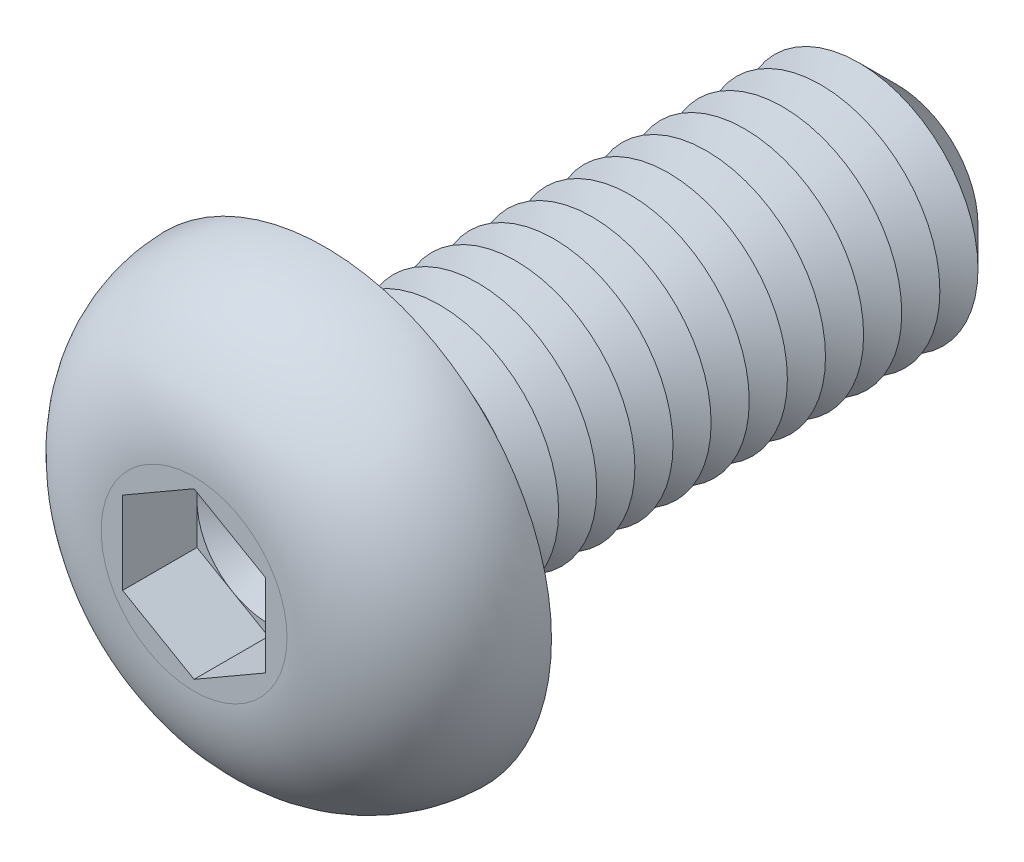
ISO-10303-21;
HEADER;
FILE_DESCRIPTION(('STEP AP214'),'2;1');
FILE_NAME('part.step','',(''),(''),'','','');
FILE_SCHEMA(('AUTOMOTIVE_DESIGN { 1 0 10303 214 1 1 1 1 }'));
ENDSEC;
DATA;
#1=APPLICATION_CONTEXT('core data for automotive mechanical design processes');
#2=APPLICATION_PROTOCOL_DEFINITION('international standard','automotive_design',2000,#1);
#3=PRODUCT_CONTEXT('',#1,'mechanical');
#4=PRODUCT('Part','Part','',(#3));
#5=PRODUCT_RELATED_PRODUCT_CATEGORY('part','',(#4));
#6=PRODUCT_DEFINITION_FORMATION('','',#4);
#7=PRODUCT_DEFINITION_CONTEXT('part definition',#1,'design');
#8=PRODUCT_DEFINITION('design','',#6,#7);
#9=PRODUCT_DEFINITION_SHAPE('','',#8);
#10=(LENGTH_UNIT() NAMED_UNIT(*) SI_UNIT(.MILLI.,.METRE.));
#11=(NAMED_UNIT(*) PLANE_ANGLE_UNIT() SI_UNIT($,.RADIAN.));
#12=(NAMED_UNIT(*) SI_UNIT($,.STERADIAN.) SOLID_ANGLE_UNIT());
#13=UNCERTAINTY_MEASURE_WITH_UNIT(LENGTH_MEASURE(1.E-05),#10,'distance_accuracy_value','');
#14=(GEOMETRIC_REPRESENTATION_CONTEXT(3) GLOBAL_UNCERTAINTY_ASSIGNED_CONTEXT((#13)) GLOBAL_UNIT_ASSIGNED_CONTEXT((#10,
#11,#12)) REPRESENTATION_CONTEXT('',''));
#15=CARTESIAN_POINT('',(0.,0.,0.));
#16=DIRECTION('',(0.,0.,1.));
#17=DIRECTION('',(1.,0.,0.));
#18=AXIS2_PLACEMENT_3D('',#15,#16,#17);
#19=CARTESIAN_POINT('',(0.,0.,1.19));
#20=DIRECTION('',(0.,0.,1.));
#21=DIRECTION('',(1.,0.,0.));
#22=AXIS2_PLACEMENT_3D('',#19,#20,#21);
#23=PLANE('',#22);
#24=CARTESIAN_POINT('',(0.,0.,1.19));
#25=DIRECTION('',(0.,0.,1.));
#26=DIRECTION('',(1.,0.,0.));
#27=AXIS2_PLACEMENT_3D('',#24,#25,#26);
#28=CIRCLE('',#27,1.5);
#29=CARTESIAN_POINT('',(1.5,0.,1.19));
#30=VERTEX_POINT('',#29);
#31=CARTESIAN_POINT('',(0.75,1.29903810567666,1.19));
#32=VERTEX_POINT('',#31);
#33=EDGE_CURVE('E117',#30,#32,#28,.T.);
#34=ORIENTED_EDGE('',*,*,#33,.F.);
#35=DIRECTION('',(0.,1.,0.));
#36=VECTOR('',#35,1.);
#37=CARTESIAN_POINT('',(1.5,-0.866025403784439,1.19));
#38=LINE('',#37,#36);
#39=CARTESIAN_POINT('',(1.5,0.86602540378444,1.19));
#40=VERTEX_POINT('',#39);
#41=EDGE_CURVE('E140',#30,#40,#38,.T.);
#42=ORIENTED_EDGE('',*,*,#41,.T.);
#43=DIRECTION('',(-0.866025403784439,0.5,0.));
#44=VECTOR('',#43,1.);
#45=CARTESIAN_POINT('',(1.5,0.86602540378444,1.19));
#46=LINE('',#45,#44);
#47=EDGE_CURVE('E135',#40,#32,#46,.T.);
#48=ORIENTED_EDGE('',*,*,#47,.T.);
#49=EDGE_LOOP('',(#34,#42,#48));
#50=FACE_BOUND('',#49,.T.);
#51=ADVANCED_FACE('F39',(#50),#23,.T.);
#52=CARTESIAN_POINT('',(0.,0.,1.19));
#53=DIRECTION('',(0.,0.,1.));
#54=DIRECTION('',(1.,0.,0.));
#55=AXIS2_PLACEMENT_3D('',#52,#53,#54);
#56=CIRCLE('',#55,1.5);
#57=CARTESIAN_POINT('',(-0.75,1.29903810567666,1.19));
#58=VERTEX_POINT('',#57);
#59=EDGE_CURVE('E11',#32,#58,#56,.T.);
#60=ORIENTED_EDGE('',*,*,#59,.F.);
#61=CARTESIAN_POINT('',(0.,1.73205080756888,1.19));
#62=VERTEX_POINT('',#61);
#63=EDGE_CURVE('E130',#32,#62,#46,.T.);
#64=ORIENTED_EDGE('',*,*,#63,.T.);
#65=DIRECTION('',(-0.866025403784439,-0.5,0.));
#66=VECTOR('',#65,1.);
#67=CARTESIAN_POINT('',(0.,1.73205080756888,1.19));
#68=LINE('',#67,#66);
#69=EDGE_CURVE('E132',#62,#58,#68,.T.);
#70=ORIENTED_EDGE('',*,*,#69,.T.);
#71=EDGE_LOOP('',(#60,#64,#70));
#72=FACE_BOUND('',#71,.T.);
#73=ADVANCED_FACE('F129',(#72),#23,.T.);
#74=CARTESIAN_POINT('',(-1.5,0.,1.19));
#75=VERTEX_POINT('',#74);
#76=EDGE_CURVE('E49',#58,#75,#56,.T.);
#77=ORIENTED_EDGE('',*,*,#76,.F.);
#78=CARTESIAN_POINT('',(-1.5,0.866025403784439,1.19));
#79=VERTEX_POINT('',#78);
#80=EDGE_CURVE('E143',#58,#79,#68,.T.);
#81=ORIENTED_EDGE('',*,*,#80,.T.);
#82=DIRECTION('',(0.,-1.,0.));
#83=VECTOR('',#82,1.);
#84=CARTESIAN_POINT('',(-1.5,0.866025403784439,1.19));
#85=LINE('',#84,#83);
#86=EDGE_CURVE('E154',#79,#75,#85,.T.);
#87=ORIENTED_EDGE('',*,*,#86,.T.);
#88=EDGE_LOOP('',(#77,#81,#87));
#89=FACE_BOUND('',#88,.T.);
#90=ADVANCED_FACE('F250',(#89),#23,.T.);
#91=CARTESIAN_POINT('',(-0.75,-1.29903810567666,1.19));
#92=VERTEX_POINT('',#91);
#93=EDGE_CURVE('E233',#75,#92,#56,.T.);
#94=ORIENTED_EDGE('',*,*,#93,.F.);
#95=CARTESIAN_POINT('',(-1.5,-0.866025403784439,1.19));
#96=VERTEX_POINT('',#95);
#97=EDGE_CURVE('E153',#75,#96,#85,.T.);
#98=ORIENTED_EDGE('',*,*,#97,.T.);
#99=DIRECTION('',(0.866025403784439,-0.5,0.));
#100=VECTOR('',#99,1.);
#101=CARTESIAN_POINT('',(-1.5,-0.866025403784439,1.19));
#102=LINE('',#101,#100);
#103=EDGE_CURVE('E159',#96,#92,#102,.T.);
#104=ORIENTED_EDGE('',*,*,#103,.T.);
#105=EDGE_LOOP('',(#94,#98,#104));
#106=FACE_BOUND('',#105,.T.);
#107=ADVANCED_FACE('F244',(#106),#23,.T.);
#108=CARTESIAN_POINT('',(0.75,-1.29903810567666,1.19));
#109=VERTEX_POINT('',#108);
#110=EDGE_CURVE('E56',#92,#109,#56,.T.);
#111=ORIENTED_EDGE('',*,*,#110,.F.);
#112=CARTESIAN_POINT('',(0.,-1.73205080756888,1.19));
#113=VERTEX_POINT('',#112);
#114=EDGE_CURVE('E158',#92,#113,#102,.T.);
#115=ORIENTED_EDGE('',*,*,#114,.T.);
#116=DIRECTION('',(0.866025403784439,0.5,0.));
#117=VECTOR('',#116,1.);
#118=CARTESIAN_POINT('',(0.,-1.73205080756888,1.19));
#119=LINE('',#118,#117);
#120=EDGE_CURVE('E164',#113,#109,#119,.T.);
#121=ORIENTED_EDGE('',*,*,#120,.T.);
#122=EDGE_LOOP('',(#111,#115,#121));
#123=FACE_BOUND('',#122,.T.);
#124=ADVANCED_FACE('F389',(#123),#23,.T.);
#125=CARTESIAN_POINT('',(0.,0.,-12.));
#126=DIRECTION('',(0.,0.,1.));
#127=DIRECTION('',(1.,0.,0.));
#128=AXIS2_PLACEMENT_3D('',#125,#126,#127);
#129=CYLINDRICAL_SURFACE('',#128,2.5);
#130=CARTESIAN_POINT('',(0.,0.,-0.399999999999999));
#131=DIRECTION('',(0.,0.,1.));
#132=DIRECTION('',(1.,0.,0.));
#133=AXIS2_PLACEMENT_3D('',#130,#131,#132);
#134=CIRCLE('',#133,2.5);
#135=CARTESIAN_POINT('',(2.5,0.,-0.399999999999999));
#136=VERTEX_POINT('',#135);
#137=EDGE_CURVE('E222',#136,#136,#134,.F.);
#138=ORIENTED_EDGE('',*,*,#137,.T.);
#139=EDGE_LOOP('',(#138));
#140=FACE_BOUND('',#139,.T.);
#141=CARTESIAN_POINT('',(0.,0.,-0.800000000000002));
#142=DIRECTION('',(0.,0.,1.));
#143=DIRECTION('',(1.,0.,0.));
#144=AXIS2_PLACEMENT_3D('',#141,#142,#143);
#145=CIRCLE('',#144,2.5);
#146=CARTESIAN_POINT('',(2.5,0.,-0.800000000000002));
#147=VERTEX_POINT('',#146);
#148=EDGE_CURVE('E149',#147,#147,#145,.T.);
#149=ORIENTED_EDGE('',*,*,#148,.T.);
#150=EDGE_LOOP('',(#149));
#151=FACE_BOUND('',#150,.T.);
#152=ADVANCED_FACE('F398',(#140,#151),#129,.T.);
#153=CARTESIAN_POINT('',(0.,4.75,0.));
#154=DIRECTION('',(0.,0.,1.));
#155=DIRECTION('',(1.,0.,0.));
#156=AXIS2_PLACEMENT_3D('',#153,#154,#155);
#157=PLANE('',#156);
#158=CARTESIAN_POINT('',(0.,0.,0.));
#159=DIRECTION('',(0.,0.,1.));
#160=DIRECTION('',(1.,0.,0.));
#161=AXIS2_PLACEMENT_3D('',#158,#159,#160);
#162=CIRCLE('',#161,2.9);
#163=CARTESIAN_POINT('',(2.9,0.,0.));
#164=VERTEX_POINT('',#163);
#165=EDGE_CURVE('E225',#164,#164,#162,.T.);
#166=ORIENTED_EDGE('',*,*,#165,.T.);
#167=EDGE_LOOP('',(#166));
#168=FACE_BOUND('',#167,.T.);
#169=CARTESIAN_POINT('',(0.,0.,0.));
#170=DIRECTION('',(0.,0.,1.));
#171=DIRECTION('',(1.,0.,0.));
#172=AXIS2_PLACEMENT_3D('',#169,#170,#171);
#173=CIRCLE('',#172,4.75);
#174=CARTESIAN_POINT('',(4.75,0.,0.));
#175=VERTEX_POINT('',#174);
#176=EDGE_CURVE('E196',#175,#175,#173,.T.);
#177=ORIENTED_EDGE('',*,*,#176,.F.);
#178=EDGE_LOOP('',(#177));
#179=FACE_BOUND('',#178,.T.);
#180=ADVANCED_FACE('F403',(#168,#179),#157,.F.);
#181=CARTESIAN_POINT('',(0.,0.,2.75));
#182=DIRECTION('',(0.,0.,-1.));
#183=DIRECTION('',(-1.,0.,0.));
#184=AXIS2_PLACEMENT_3D('',#181,#182,#183);
#185=PLANE('',#184);
#186=DIRECTION('',(-0.866025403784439,-0.5,0.));
#187=VECTOR('',#186,1.);
#188=CARTESIAN_POINT('',(0.,1.73205080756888,2.75));
#189=LINE('',#188,#187);
#190=CARTESIAN_POINT('',(0.,1.73205080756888,2.75));
#191=VERTEX_POINT('',#190);
#192=CARTESIAN_POINT('',(-1.5,0.866025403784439,2.75));
#193=VERTEX_POINT('',#192);
#194=EDGE_CURVE('E174',#191,#193,#189,.T.);
#195=ORIENTED_EDGE('',*,*,#194,.F.);
#196=DIRECTION('',(-0.866025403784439,0.5,0.));
#197=VECTOR('',#196,1.);
#198=CARTESIAN_POINT('',(1.5,0.86602540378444,2.75));
#199=LINE('',#198,#197);
#200=CARTESIAN_POINT('',(1.5,0.86602540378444,2.75));
#201=VERTEX_POINT('',#200);
#202=EDGE_CURVE('E64',#201,#191,#199,.T.);
#203=ORIENTED_EDGE('',*,*,#202,.F.);
#204=DIRECTION('',(0.,1.,0.));
#205=VECTOR('',#204,1.);
#206=CARTESIAN_POINT('',(1.5,-0.866025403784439,2.75));
#207=LINE('',#206,#205);
#208=CARTESIAN_POINT('',(1.5,-0.866025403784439,2.75));
#209=VERTEX_POINT('',#208);
#210=EDGE_CURVE('E138',#209,#201,#207,.T.);
#211=ORIENTED_EDGE('',*,*,#210,.F.);
#212=DIRECTION('',(0.866025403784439,0.5,0.));
#213=VECTOR('',#212,1.);
#214=CARTESIAN_POINT('',(0.,-1.73205080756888,2.75));
#215=LINE('',#214,#213);
#216=CARTESIAN_POINT('',(0.,-1.73205080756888,2.75));
#217=VERTEX_POINT('',#216);
#218=EDGE_CURVE('E186',#217,#209,#215,.T.);
#219=ORIENTED_EDGE('',*,*,#218,.F.);
#220=DIRECTION('',(0.866025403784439,-0.5,0.));
#221=VECTOR('',#220,1.);
#222=CARTESIAN_POINT('',(-1.5,-0.866025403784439,2.75));
#223=LINE('',#222,#221);
#224=CARTESIAN_POINT('',(-1.5,-0.866025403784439,2.75));
#225=VERTEX_POINT('',#224);
#226=EDGE_CURVE('E182',#225,#217,#223,.T.);
#227=ORIENTED_EDGE('',*,*,#226,.F.);
#228=DIRECTION('',(0.,-1.,0.));
#229=VECTOR('',#228,1.);
#230=CARTESIAN_POINT('',(-1.5,0.866025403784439,2.75));
#231=LINE('',#230,#229);
#232=EDGE_CURVE('E178',#193,#225,#231,.T.);
#233=ORIENTED_EDGE('',*,*,#232,.F.);
#234=EDGE_LOOP('',(#195,#203,#211,#219,#227,#233));
#235=FACE_BOUND('',#234,.T.);
#236=CARTESIAN_POINT('',(0.,0.,2.75));
#237=DIRECTION('',(0.,0.,1.));
#238=DIRECTION('',(1.,0.,0.));
#239=AXIS2_PLACEMENT_3D('',#236,#237,#238);
#240=CIRCLE('',#239,1.95044646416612);
#241=CARTESIAN_POINT('',(1.95044646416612,0.,2.75));
#242=VERTEX_POINT('',#241);
#243=EDGE_CURVE('E214',#242,#242,#240,.T.);
#244=ORIENTED_EDGE('',*,*,#243,.T.);
#245=EDGE_LOOP('',(#244));
#246=FACE_BOUND('',#245,.T.);
#247=ADVANCED_FACE('F259',(#235,#246),#185,.F.);
#248=CARTESIAN_POINT('',(0.,0.,-0.0500000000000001));
#249=DIRECTION('',(0.,0.,1.));
#250=DIRECTION('',(1.,0.,0.));
#251=AXIS2_PLACEMENT_3D('',#248,#249,#250);
#252=DEGENERATE_TOROIDAL_SURFACE('',#251,1.95044646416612,2.8,.T.);
#253=ORIENTED_EDGE('',*,*,#243,.F.);
#254=EDGE_LOOP('',(#253));
#255=FACE_BOUND('',#254,.T.);
#256=ORIENTED_EDGE('',*,*,#176,.T.);
#257=EDGE_LOOP('',(#256));
#258=FACE_BOUND('',#257,.T.);
#259=ADVANCED_FACE('F423',(#255,#258),#252,.T.);
#260=CARTESIAN_POINT('',(1.5,0.86602540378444,1.19));
#261=DIRECTION('',(0.5,0.866025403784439,0.));
#262=DIRECTION('',(-0.866025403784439,0.5,0.));
#263=AXIS2_PLACEMENT_3D('',#260,#261,#262);
#264=PLANE('',#263);
#265=ORIENTED_EDGE('',*,*,#202,.T.);
#266=DIRECTION('',(0.,0.,1.));
#267=VECTOR('',#266,1.);
#268=CARTESIAN_POINT('',(0.,1.73205080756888,1.19));
#269=LINE('',#268,#267);
#270=EDGE_CURVE('E136',#62,#191,#269,.T.);
#271=ORIENTED_EDGE('',*,*,#270,.F.);
#272=ORIENTED_EDGE('',*,*,#63,.F.);
#273=ORIENTED_EDGE('',*,*,#47,.F.);
#274=DIRECTION('',(0.,0.,1.));
#275=VECTOR('',#274,1.);
#276=CARTESIAN_POINT('',(1.5,0.86602540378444,1.19));
#277=LINE('',#276,#275);
#278=EDGE_CURVE('E193',#40,#201,#277,.T.);
#279=ORIENTED_EDGE('',*,*,#278,.T.);
#280=EDGE_LOOP('',(#265,#271,#272,#273,#279));
#281=FACE_BOUND('',#280,.T.);
#282=ADVANCED_FACE('F134',(#281),#264,.F.);
#283=CARTESIAN_POINT('',(1.5,-0.866025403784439,1.19));
#284=DIRECTION('',(1.,0.,0.));
#285=DIRECTION('',(0.,1.,0.));
#286=AXIS2_PLACEMENT_3D('',#283,#284,#285);
#287=PLANE('',#286);
#288=ORIENTED_EDGE('',*,*,#210,.T.);
#289=ORIENTED_EDGE('',*,*,#278,.F.);
#290=ORIENTED_EDGE('',*,*,#41,.F.);
#291=CARTESIAN_POINT('',(1.5,-0.866025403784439,1.19));
#292=VERTEX_POINT('',#291);
#293=EDGE_CURVE('E168',#292,#30,#38,.T.);
#294=ORIENTED_EDGE('',*,*,#293,.F.);
#295=DIRECTION('',(0.,0.,1.));
#296=VECTOR('',#295,1.);
#297=CARTESIAN_POINT('',(1.5,-0.866025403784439,1.19));
#298=LINE('',#297,#296);
#299=EDGE_CURVE('E197',#292,#209,#298,.T.);
#300=ORIENTED_EDGE('',*,*,#299,.T.);
#301=EDGE_LOOP('',(#288,#289,#290,#294,#300));
#302=FACE_BOUND('',#301,.T.);
#303=ADVANCED_FACE('F416',(#302),#287,.F.);
#304=CARTESIAN_POINT('',(0.,-1.73205080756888,1.19));
#305=DIRECTION('',(0.5,-0.866025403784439,0.));
#306=DIRECTION('',(0.866025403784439,0.5,0.));
#307=AXIS2_PLACEMENT_3D('',#304,#305,#306);
#308=PLANE('',#307);
#309=ORIENTED_EDGE('',*,*,#218,.T.);
#310=ORIENTED_EDGE('',*,*,#299,.F.);
#311=EDGE_CURVE('E163',#109,#292,#119,.T.);
#312=ORIENTED_EDGE('',*,*,#311,.F.);
#313=ORIENTED_EDGE('',*,*,#120,.F.);
#314=DIRECTION('',(0.,0.,1.));
#315=VECTOR('',#314,1.);
#316=CARTESIAN_POINT('',(0.,-1.73205080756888,1.19));
#317=LINE('',#316,#315);
#318=EDGE_CURVE('E200',#113,#217,#317,.T.);
#319=ORIENTED_EDGE('',*,*,#318,.T.);
#320=EDGE_LOOP('',(#309,#310,#312,#313,#319));
#321=FACE_BOUND('',#320,.T.);
#322=ADVANCED_FACE('F407',(#321),#308,.F.);
#323=CARTESIAN_POINT('',(-1.5,-0.866025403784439,1.19));
#324=DIRECTION('',(-0.5,-0.866025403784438,0.));
#325=DIRECTION('',(0.866025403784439,-0.5,0.));
#326=AXIS2_PLACEMENT_3D('',#323,#324,#325);
#327=PLANE('',#326);
#328=ORIENTED_EDGE('',*,*,#226,.T.);
#329=ORIENTED_EDGE('',*,*,#318,.F.);
#330=ORIENTED_EDGE('',*,*,#114,.F.);
#331=ORIENTED_EDGE('',*,*,#103,.F.);
#332=DIRECTION('',(0.,0.,1.));
#333=VECTOR('',#332,1.);
#334=CARTESIAN_POINT('',(-1.5,-0.866025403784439,1.19));
#335=LINE('',#334,#333);
#336=EDGE_CURVE('E203',#96,#225,#335,.T.);
#337=ORIENTED_EDGE('',*,*,#336,.T.);
#338=EDGE_LOOP('',(#328,#329,#330,#331,#337));
#339=FACE_BOUND('',#338,.T.);
#340=ADVANCED_FACE('F264',(#339),#327,.F.);
#341=CARTESIAN_POINT('',(-1.5,0.866025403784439,1.19));
#342=DIRECTION('',(-1.,0.,0.));
#343=DIRECTION('',(0.,-1.,0.));
#344=AXIS2_PLACEMENT_3D('',#341,#342,#343);
#345=PLANE('',#344);
#346=ORIENTED_EDGE('',*,*,#232,.T.);
#347=ORIENTED_EDGE('',*,*,#336,.F.);
#348=ORIENTED_EDGE('',*,*,#97,.F.);
#349=ORIENTED_EDGE('',*,*,#86,.F.);
#350=DIRECTION('',(0.,0.,1.));
#351=VECTOR('',#350,1.);
#352=CARTESIAN_POINT('',(-1.5,0.866025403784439,1.19));
#353=LINE('',#352,#351);
#354=EDGE_CURVE('E206',#79,#193,#353,.T.);
#355=ORIENTED_EDGE('',*,*,#354,.T.);
#356=EDGE_LOOP('',(#346,#347,#348,#349,#355));
#357=FACE_BOUND('',#356,.T.);
#358=ADVANCED_FACE('F249',(#357),#345,.F.);
#359=CARTESIAN_POINT('',(0.,1.73205080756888,1.19));
#360=DIRECTION('',(-0.5,0.866025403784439,0.));
#361=DIRECTION('',(-0.866025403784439,-0.5,0.));
#362=AXIS2_PLACEMENT_3D('',#359,#360,#361);
#363=PLANE('',#362);
#364=ORIENTED_EDGE('',*,*,#194,.T.);
#365=ORIENTED_EDGE('',*,*,#354,.F.);
#366=ORIENTED_EDGE('',*,*,#80,.F.);
#367=ORIENTED_EDGE('',*,*,#69,.F.);
#368=ORIENTED_EDGE('',*,*,#270,.T.);
#369=EDGE_LOOP('',(#364,#365,#366,#367,#368));
#370=FACE_BOUND('',#369,.T.);
#371=ADVANCED_FACE('F253',(#370),#363,.F.);
#372=EDGE_CURVE('E43',#109,#30,#56,.T.);
#373=ORIENTED_EDGE('',*,*,#372,.F.);
#374=ORIENTED_EDGE('',*,*,#311,.T.);
#375=ORIENTED_EDGE('',*,*,#293,.T.);
#376=EDGE_LOOP('',(#373,#374,#375));
#377=FACE_BOUND('',#376,.T.);
#378=ADVANCED_FACE('F381',(#377),#23,.T.);
#379=CARTESIAN_POINT('',(0.,0.,-0.800000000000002));
#380=DIRECTION('',(0.,0.,1.));
#381=DIRECTION('',(1.,0.,0.));
#382=AXIS2_PLACEMENT_3D('',#379,#380,#381);
#383=CONICAL_SURFACE('',#382,2.5,1.0471975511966);
#384=CARTESIAN_POINT('',(0.,0.,-1.2));
#385=DIRECTION('',(0.,0.,1.));
#386=DIRECTION('',(1.,0.,0.));
#387=AXIS2_PLACEMENT_3D('',#384,#385,#386);
#388=CIRCLE('',#387,1.80717967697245);
#389=CARTESIAN_POINT('',(1.80717967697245,0.,-1.2));
#390=VERTEX_POINT('',#389);
#391=EDGE_CURVE('E298',#390,#390,#388,.T.);
#392=ORIENTED_EDGE('',*,*,#391,.T.);
#393=EDGE_LOOP('',(#392));
#394=FACE_BOUND('',#393,.T.);
#395=ORIENTED_EDGE('',*,*,#148,.F.);
#396=EDGE_LOOP('',(#395));
#397=FACE_BOUND('',#396,.T.);
#398=ADVANCED_FACE('F377',(#394,#397),#383,.T.);
#399=CARTESIAN_POINT('',(0.,0.,-1.2));
#400=DIRECTION('',(0.,0.,-1.));
#401=DIRECTION('',(-1.,0.,0.));
#402=AXIS2_PLACEMENT_3D('',#399,#400,#401);
#403=CONICAL_SURFACE('',#402,1.80717967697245,1.04719755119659);
#404=CARTESIAN_POINT('',(0.,0.,-1.6));
#405=DIRECTION('',(0.,0.,1.));
#406=DIRECTION('',(1.,0.,0.));
#407=AXIS2_PLACEMENT_3D('',#404,#405,#406);
#408=CIRCLE('',#407,2.5);
#409=CARTESIAN_POINT('',(2.5,0.,-1.6));
#410=VERTEX_POINT('',#409);
#411=EDGE_CURVE('E300',#410,#410,#408,.T.);
#412=ORIENTED_EDGE('',*,*,#411,.T.);
#413=EDGE_LOOP('',(#412));
#414=FACE_BOUND('',#413,.T.);
#415=ORIENTED_EDGE('',*,*,#391,.F.);
#416=EDGE_LOOP('',(#415));
#417=FACE_BOUND('',#416,.T.);
#418=ADVANCED_FACE('F362',(#414,#417),#403,.T.);
#419=CARTESIAN_POINT('',(0.,0.,-1.6));
#420=DIRECTION('',(0.,0.,1.));
#421=DIRECTION('',(1.,0.,0.));
#422=AXIS2_PLACEMENT_3D('',#419,#420,#421);
#423=CONICAL_SURFACE('',#422,2.5,1.0471975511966);
#424=CARTESIAN_POINT('',(0.,0.,-2.));
#425=DIRECTION('',(0.,0.,1.));
#426=DIRECTION('',(1.,0.,0.));
#427=AXIS2_PLACEMENT_3D('',#424,#425,#426);
#428=CIRCLE('',#427,1.80717967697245);
#429=CARTESIAN_POINT('',(1.80717967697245,0.,-2.));
#430=VERTEX_POINT('',#429);
#431=EDGE_CURVE('E353',#430,#430,#428,.T.);
#432=ORIENTED_EDGE('',*,*,#431,.T.);
#433=EDGE_LOOP('',(#432));
#434=FACE_BOUND('',#433,.T.);
#435=ORIENTED_EDGE('',*,*,#411,.F.);
#436=EDGE_LOOP('',(#435));
#437=FACE_BOUND('',#436,.T.);
#438=ADVANCED_FACE('F365',(#434,#437),#423,.T.);
#439=CARTESIAN_POINT('',(0.,0.,-2.));
#440=DIRECTION('',(0.,0.,-1.));
#441=DIRECTION('',(-1.,0.,0.));
#442=AXIS2_PLACEMENT_3D('',#439,#440,#441);
#443=CONICAL_SURFACE('',#442,1.80717967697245,1.04719755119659);
#444=CARTESIAN_POINT('',(0.,0.,-2.4));
#445=DIRECTION('',(0.,0.,1.));
#446=DIRECTION('',(1.,0.,0.));
#447=AXIS2_PLACEMENT_3D('',#444,#445,#446);
#448=CIRCLE('',#447,2.5);
#449=CARTESIAN_POINT('',(2.5,0.,-2.4));
#450=VERTEX_POINT('',#449);
#451=EDGE_CURVE('E349',#450,#450,#448,.T.);
#452=ORIENTED_EDGE('',*,*,#451,.T.);
#453=EDGE_LOOP('',(#452));
#454=FACE_BOUND('',#453,.T.);
#455=ORIENTED_EDGE('',*,*,#431,.F.);
#456=EDGE_LOOP('',(#455));
#457=FACE_BOUND('',#456,.T.);
#458=ADVANCED_FACE('F367',(#454,#457),#443,.T.);
#459=CARTESIAN_POINT('',(0.,0.,-2.4));
#460=DIRECTION('',(0.,0.,1.));
#461=DIRECTION('',(1.,0.,0.));
#462=AXIS2_PLACEMENT_3D('',#459,#460,#461);
#463=CONICAL_SURFACE('',#462,2.5,1.0471975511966);
#464=CARTESIAN_POINT('',(0.,0.,-2.8));
#465=DIRECTION('',(0.,0.,1.));
#466=DIRECTION('',(1.,0.,0.));
#467=AXIS2_PLACEMENT_3D('',#464,#465,#466);
#468=CIRCLE('',#467,1.80717967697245);
#469=CARTESIAN_POINT('',(1.80717967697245,0.,-2.8));
#470=VERTEX_POINT('',#469);
#471=EDGE_CURVE('E345',#470,#470,#468,.T.);
#472=ORIENTED_EDGE('',*,*,#471,.T.);
#473=EDGE_LOOP('',(#472));
#474=FACE_BOUND('',#473,.T.);
#475=ORIENTED_EDGE('',*,*,#451,.F.);
#476=EDGE_LOOP('',(#475));
#477=FACE_BOUND('',#476,.T.);
#478=ADVANCED_FACE('F374',(#474,#477),#463,.T.);
#479=CARTESIAN_POINT('',(0.,0.,-2.8));
#480=DIRECTION('',(0.,0.,-1.));
#481=DIRECTION('',(-1.,0.,0.));
#482=AXIS2_PLACEMENT_3D('',#479,#480,#481);
#483=CONICAL_SURFACE('',#482,1.80717967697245,1.04719755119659);
#484=CARTESIAN_POINT('',(0.,0.,-3.2));
#485=DIRECTION('',(0.,0.,1.));
#486=DIRECTION('',(1.,0.,0.));
#487=AXIS2_PLACEMENT_3D('',#484,#485,#486);
#488=CIRCLE('',#487,2.5);
#489=CARTESIAN_POINT('',(2.5,0.,-3.2));
#490=VERTEX_POINT('',#489);
#491=EDGE_CURVE('E342',#490,#490,#488,.T.);
#492=ORIENTED_EDGE('',*,*,#491,.T.);
#493=EDGE_LOOP('',(#492));
#494=FACE_BOUND('',#493,.T.);
#495=ORIENTED_EDGE('',*,*,#471,.F.);
#496=EDGE_LOOP('',(#495));
#497=FACE_BOUND('',#496,.T.);
#498=ADVANCED_FACE('F532',(#494,#497),#483,.T.);
#499=CARTESIAN_POINT('',(0.,0.,-3.2));
#500=DIRECTION('',(0.,0.,1.));
#501=DIRECTION('',(1.,0.,0.));
#502=AXIS2_PLACEMENT_3D('',#499,#500,#501);
#503=CONICAL_SURFACE('',#502,2.5,1.0471975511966);
#504=CARTESIAN_POINT('',(0.,0.,-3.6));
#505=DIRECTION('',(0.,0.,1.));
#506=DIRECTION('',(1.,0.,0.));
#507=AXIS2_PLACEMENT_3D('',#504,#505,#506);
#508=CIRCLE('',#507,1.80717967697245);
#509=CARTESIAN_POINT('',(1.80717967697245,0.,-3.6));
#510=VERTEX_POINT('',#509);
#511=EDGE_CURVE('E338',#510,#510,#508,.T.);
#512=ORIENTED_EDGE('',*,*,#511,.T.);
#513=EDGE_LOOP('',(#512));
#514=FACE_BOUND('',#513,.T.);
#515=ORIENTED_EDGE('',*,*,#491,.F.);
#516=EDGE_LOOP('',(#515));
#517=FACE_BOUND('',#516,.T.);
#518=ADVANCED_FACE('F528',(#514,#517),#503,.T.);
#519=CARTESIAN_POINT('',(0.,0.,-3.6));
#520=DIRECTION('',(0.,0.,-1.));
#521=DIRECTION('',(-1.,0.,0.));
#522=AXIS2_PLACEMENT_3D('',#519,#520,#521);
#523=CONICAL_SURFACE('',#522,1.80717967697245,1.04719755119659);
#524=CARTESIAN_POINT('',(0.,0.,-4.));
#525=DIRECTION('',(0.,0.,1.));
#526=DIRECTION('',(1.,0.,0.));
#527=AXIS2_PLACEMENT_3D('',#524,#525,#526);
#528=CIRCLE('',#527,2.5);
#529=CARTESIAN_POINT('',(2.5,0.,-4.));
#530=VERTEX_POINT('',#529);
#531=EDGE_CURVE('E334',#530,#530,#528,.T.);
#532=ORIENTED_EDGE('',*,*,#531,.T.);
#533=EDGE_LOOP('',(#532));
#534=FACE_BOUND('',#533,.T.);
#535=ORIENTED_EDGE('',*,*,#511,.F.);
#536=EDGE_LOOP('',(#535));
#537=FACE_BOUND('',#536,.T.);
#538=ADVANCED_FACE('F524',(#534,#537),#523,.T.);
#539=CARTESIAN_POINT('',(0.,0.,-4.));
#540=DIRECTION('',(0.,0.,1.));
#541=DIRECTION('',(1.,0.,0.));
#542=AXIS2_PLACEMENT_3D('',#539,#540,#541);
#543=CONICAL_SURFACE('',#542,2.5,1.0471975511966);
#544=CARTESIAN_POINT('',(0.,0.,-4.4));
#545=DIRECTION('',(0.,0.,1.));
#546=DIRECTION('',(1.,0.,0.));
#547=AXIS2_PLACEMENT_3D('',#544,#545,#546);
#548=CIRCLE('',#547,1.80717967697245);
#549=CARTESIAN_POINT('',(1.80717967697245,0.,-4.4));
#550=VERTEX_POINT('',#549);
#551=EDGE_CURVE('E330',#550,#550,#548,.T.);
#552=ORIENTED_EDGE('',*,*,#551,.T.);
#553=EDGE_LOOP('',(#552));
#554=FACE_BOUND('',#553,.T.);
#555=ORIENTED_EDGE('',*,*,#531,.F.);
#556=EDGE_LOOP('',(#555));
#557=FACE_BOUND('',#556,.T.);
#558=ADVANCED_FACE('F520',(#554,#557),#543,.T.);
#559=CARTESIAN_POINT('',(0.,0.,-4.4));
#560=DIRECTION('',(0.,0.,-1.));
#561=DIRECTION('',(-1.,0.,0.));
#562=AXIS2_PLACEMENT_3D('',#559,#560,#561);
#563=CONICAL_SURFACE('',#562,1.80717967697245,1.04719755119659);
#564=CARTESIAN_POINT('',(0.,0.,-4.8));
#565=DIRECTION('',(0.,0.,1.));
#566=DIRECTION('',(1.,0.,0.));
#567=AXIS2_PLACEMENT_3D('',#564,#565,#566);
#568=CIRCLE('',#567,2.5);
#569=CARTESIAN_POINT('',(2.5,0.,-4.8));
#570=VERTEX_POINT('',#569);
#571=EDGE_CURVE('E309',#570,#570,#568,.T.);
#572=ORIENTED_EDGE('',*,*,#571,.T.);
#573=EDGE_LOOP('',(#572));
#574=FACE_BOUND('',#573,.T.);
#575=ORIENTED_EDGE('',*,*,#551,.F.);
#576=EDGE_LOOP('',(#575));
#577=FACE_BOUND('',#576,.T.);
#578=ADVANCED_FACE('F516',(#574,#577),#563,.T.);
#579=CARTESIAN_POINT('',(0.,0.,-4.8));
#580=DIRECTION('',(0.,0.,1.));
#581=DIRECTION('',(1.,0.,0.));
#582=AXIS2_PLACEMENT_3D('',#579,#580,#581);
#583=CONICAL_SURFACE('',#582,2.5,1.0471975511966);
#584=CARTESIAN_POINT('',(0.,0.,-5.2));
#585=DIRECTION('',(0.,0.,1.));
#586=DIRECTION('',(1.,0.,0.));
#587=AXIS2_PLACEMENT_3D('',#584,#585,#586);
#588=CIRCLE('',#587,1.80717967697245);
#589=CARTESIAN_POINT('',(1.80717967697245,0.,-5.2));
#590=VERTEX_POINT('',#589);
#591=EDGE_CURVE('E305',#590,#590,#588,.T.);
#592=ORIENTED_EDGE('',*,*,#591,.T.);
#593=EDGE_LOOP('',(#592));
#594=FACE_BOUND('',#593,.T.);
#595=ORIENTED_EDGE('',*,*,#571,.F.);
#596=EDGE_LOOP('',(#595));
#597=FACE_BOUND('',#596,.T.);
#598=ADVANCED_FACE('F512',(#594,#597),#583,.T.);
#599=CARTESIAN_POINT('',(0.,0.,-5.2));
#600=DIRECTION('',(0.,0.,-1.));
#601=DIRECTION('',(-1.,0.,0.));
#602=AXIS2_PLACEMENT_3D('',#599,#600,#601);
#603=CONICAL_SURFACE('',#602,1.80717967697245,1.04719755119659);
#604=CARTESIAN_POINT('',(0.,0.,-5.6));
#605=DIRECTION('',(0.,0.,1.));
#606=DIRECTION('',(1.,0.,0.));
#607=AXIS2_PLACEMENT_3D('',#604,#605,#606);
#608=CIRCLE('',#607,2.5);
#609=CARTESIAN_POINT('',(2.5,0.,-5.6));
#610=VERTEX_POINT('',#609);
#611=EDGE_CURVE('E302',#610,#610,#608,.T.);
#612=ORIENTED_EDGE('',*,*,#611,.T.);
#613=EDGE_LOOP('',(#612));
#614=FACE_BOUND('',#613,.T.);
#615=ORIENTED_EDGE('',*,*,#591,.F.);
#616=EDGE_LOOP('',(#615));
#617=FACE_BOUND('',#616,.T.);
#618=ADVANCED_FACE('F508',(#614,#617),#603,.T.);
#619=CARTESIAN_POINT('',(0.,0.,-5.6));
#620=DIRECTION('',(0.,0.,1.));
#621=DIRECTION('',(1.,0.,0.));
#622=AXIS2_PLACEMENT_3D('',#619,#620,#621);
#623=CONICAL_SURFACE('',#622,2.5,1.0471975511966);
#624=CARTESIAN_POINT('',(0.,0.,-6.));
#625=DIRECTION('',(0.,0.,1.));
#626=DIRECTION('',(1.,0.,0.));
#627=AXIS2_PLACEMENT_3D('',#624,#625,#626);
#628=CIRCLE('',#627,1.80717967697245);
#629=CARTESIAN_POINT('',(1.80717967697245,0.,-6.));
#630=VERTEX_POINT('',#629);
#631=EDGE_CURVE('E306',#630,#630,#628,.T.);
#632=ORIENTED_EDGE('',*,*,#631,.T.);
#633=EDGE_LOOP('',(#632));
#634=FACE_BOUND('',#633,.T.);
#635=ORIENTED_EDGE('',*,*,#611,.F.);
#636=EDGE_LOOP('',(#635));
#637=FACE_BOUND('',#636,.T.);
#638=ADVANCED_FACE('F504',(#634,#637),#623,.T.);
#639=CARTESIAN_POINT('',(0.,0.,-6.));
#640=DIRECTION('',(0.,0.,-1.));
#641=DIRECTION('',(-1.,0.,0.));
#642=AXIS2_PLACEMENT_3D('',#639,#640,#641);
#643=CONICAL_SURFACE('',#642,1.80717967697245,1.04719755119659);
#644=CARTESIAN_POINT('',(0.,0.,-6.4));
#645=DIRECTION('',(0.,0.,1.));
#646=DIRECTION('',(1.,0.,0.));
#647=AXIS2_PLACEMENT_3D('',#644,#645,#646);
#648=CIRCLE('',#647,2.5);
#649=CARTESIAN_POINT('',(2.5,0.,-6.4));
#650=VERTEX_POINT('',#649);
#651=EDGE_CURVE('E284',#650,#650,#648,.T.);
#652=ORIENTED_EDGE('',*,*,#651,.T.);
#653=EDGE_LOOP('',(#652));
#654=FACE_BOUND('',#653,.T.);
#655=ORIENTED_EDGE('',*,*,#631,.F.);
#656=EDGE_LOOP('',(#655));
#657=FACE_BOUND('',#656,.T.);
#658=ADVANCED_FACE('F500',(#654,#657),#643,.T.);
#659=CARTESIAN_POINT('',(0.,0.,-6.4));
#660=DIRECTION('',(0.,0.,1.));
#661=DIRECTION('',(1.,0.,0.));
#662=AXIS2_PLACEMENT_3D('',#659,#660,#661);
#663=CONICAL_SURFACE('',#662,2.5,1.0471975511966);
#664=CARTESIAN_POINT('',(0.,0.,-6.8));
#665=DIRECTION('',(0.,0.,1.));
#666=DIRECTION('',(1.,0.,0.));
#667=AXIS2_PLACEMENT_3D('',#664,#665,#666);
#668=CIRCLE('',#667,1.80717967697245);
#669=CARTESIAN_POINT('',(1.80717967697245,0.,-6.8));
#670=VERTEX_POINT('',#669);
#671=EDGE_CURVE('E282',#670,#670,#668,.T.);
#672=ORIENTED_EDGE('',*,*,#671,.T.);
#673=EDGE_LOOP('',(#672));
#674=FACE_BOUND('',#673,.T.);
#675=ORIENTED_EDGE('',*,*,#651,.F.);
#676=EDGE_LOOP('',(#675));
#677=FACE_BOUND('',#676,.T.);
#678=ADVANCED_FACE('F497',(#674,#677),#663,.T.);
#679=CARTESIAN_POINT('',(0.,0.,-6.8));
#680=DIRECTION('',(0.,0.,-1.));
#681=DIRECTION('',(-1.,0.,0.));
#682=AXIS2_PLACEMENT_3D('',#679,#680,#681);
#683=CONICAL_SURFACE('',#682,1.80717967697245,1.04719755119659);
#684=CARTESIAN_POINT('',(0.,0.,-7.2));
#685=DIRECTION('',(0.,0.,1.));
#686=DIRECTION('',(1.,0.,0.));
#687=AXIS2_PLACEMENT_3D('',#684,#685,#686);
#688=CIRCLE('',#687,2.5);
#689=CARTESIAN_POINT('',(2.5,0.,-7.2));
#690=VERTEX_POINT('',#689);
#691=EDGE_CURVE('E285',#690,#690,#688,.T.);
#692=ORIENTED_EDGE('',*,*,#691,.T.);
#693=EDGE_LOOP('',(#692));
#694=FACE_BOUND('',#693,.T.);
#695=ORIENTED_EDGE('',*,*,#671,.F.);
#696=EDGE_LOOP('',(#695));
#697=FACE_BOUND('',#696,.T.);
#698=ADVANCED_FACE('F493',(#694,#697),#683,.T.);
#699=CARTESIAN_POINT('',(0.,0.,-7.2));
#700=DIRECTION('',(0.,0.,1.));
#701=DIRECTION('',(1.,0.,0.));
#702=AXIS2_PLACEMENT_3D('',#699,#700,#701);
#703=CONICAL_SURFACE('',#702,2.5,1.0471975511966);
#704=CARTESIAN_POINT('',(0.,0.,-7.6));
#705=DIRECTION('',(0.,0.,1.));
#706=DIRECTION('',(1.,0.,0.));
#707=AXIS2_PLACEMENT_3D('',#704,#705,#706);
#708=CIRCLE('',#707,1.80717967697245);
#709=CARTESIAN_POINT('',(1.80717967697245,0.,-7.6));
#710=VERTEX_POINT('',#709);
#711=EDGE_CURVE('E272',#710,#710,#708,.T.);
#712=ORIENTED_EDGE('',*,*,#711,.T.);
#713=EDGE_LOOP('',(#712));
#714=FACE_BOUND('',#713,.T.);
#715=ORIENTED_EDGE('',*,*,#691,.F.);
#716=EDGE_LOOP('',(#715));
#717=FACE_BOUND('',#716,.T.);
#718=ADVANCED_FACE('F489',(#714,#717),#703,.T.);
#719=CARTESIAN_POINT('',(0.,0.,-7.6));
#720=DIRECTION('',(0.,0.,-1.));
#721=DIRECTION('',(-1.,0.,0.));
#722=AXIS2_PLACEMENT_3D('',#719,#720,#721);
#723=CONICAL_SURFACE('',#722,1.80717967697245,1.04719755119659);
#724=CARTESIAN_POINT('',(0.,0.,-8.));
#725=DIRECTION('',(0.,0.,1.));
#726=DIRECTION('',(1.,0.,0.));
#727=AXIS2_PLACEMENT_3D('',#724,#725,#726);
#728=CIRCLE('',#727,2.5);
#729=CARTESIAN_POINT('',(2.5,0.,-8.));
#730=VERTEX_POINT('',#729);
#731=EDGE_CURVE('E270',#730,#730,#728,.T.);
#732=ORIENTED_EDGE('',*,*,#731,.T.);
#733=EDGE_LOOP('',(#732));
#734=FACE_BOUND('',#733,.T.);
#735=ORIENTED_EDGE('',*,*,#711,.F.);
#736=EDGE_LOOP('',(#735));
#737=FACE_BOUND('',#736,.T.);
#738=ADVANCED_FACE('F485',(#734,#737),#723,.T.);
#739=CARTESIAN_POINT('',(0.,0.,-8.));
#740=DIRECTION('',(0.,0.,1.));
#741=DIRECTION('',(1.,0.,0.));
#742=AXIS2_PLACEMENT_3D('',#739,#740,#741);
#743=CONICAL_SURFACE('',#742,2.5,1.0471975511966);
#744=CARTESIAN_POINT('',(0.,0.,-8.4));
#745=DIRECTION('',(0.,0.,1.));
#746=DIRECTION('',(1.,0.,0.));
#747=AXIS2_PLACEMENT_3D('',#744,#745,#746);
#748=CIRCLE('',#747,1.80717967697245);
#749=CARTESIAN_POINT('',(1.80717967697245,0.,-8.4));
#750=VERTEX_POINT('',#749);
#751=EDGE_CURVE('E273',#750,#750,#748,.T.);
#752=ORIENTED_EDGE('',*,*,#751,.T.);
#753=EDGE_LOOP('',(#752));
#754=FACE_BOUND('',#753,.T.);
#755=ORIENTED_EDGE('',*,*,#731,.F.);
#756=EDGE_LOOP('',(#755));
#757=FACE_BOUND('',#756,.T.);
#758=ADVANCED_FACE('F479',(#754,#757),#743,.T.);
#759=CARTESIAN_POINT('',(0.,0.,-8.4));
#760=DIRECTION('',(0.,0.,-1.));
#761=DIRECTION('',(-1.,0.,0.));
#762=AXIS2_PLACEMENT_3D('',#759,#760,#761);
#763=CONICAL_SURFACE('',#762,1.80717967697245,1.04719755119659);
#764=CARTESIAN_POINT('',(0.,0.,-8.8));
#765=DIRECTION('',(0.,0.,1.));
#766=DIRECTION('',(1.,0.,0.));
#767=AXIS2_PLACEMENT_3D('',#764,#765,#766);
#768=CIRCLE('',#767,2.5);
#769=CARTESIAN_POINT('',(2.5,0.,-8.8));
#770=VERTEX_POINT('',#769);
#771=EDGE_CURVE('E279',#770,#770,#768,.T.);
#772=ORIENTED_EDGE('',*,*,#771,.T.);
#773=EDGE_LOOP('',(#772));
#774=FACE_BOUND('',#773,.T.);
#775=ORIENTED_EDGE('',*,*,#751,.F.);
#776=EDGE_LOOP('',(#775));
#777=FACE_BOUND('',#776,.T.);
#778=ADVANCED_FACE('F464',(#774,#777),#763,.T.);
#779=CARTESIAN_POINT('',(0.,0.,-8.8));
#780=DIRECTION('',(0.,0.,1.));
#781=DIRECTION('',(1.,0.,0.));
#782=AXIS2_PLACEMENT_3D('',#779,#780,#781);
#783=CONICAL_SURFACE('',#782,2.5,1.0471975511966);
#784=CARTESIAN_POINT('',(0.,0.,-9.2));
#785=DIRECTION('',(0.,0.,1.));
#786=DIRECTION('',(1.,0.,0.));
#787=AXIS2_PLACEMENT_3D('',#784,#785,#786);
#788=CIRCLE('',#787,1.80717967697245);
#789=CARTESIAN_POINT('',(1.80717967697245,0.,-9.2));
#790=VERTEX_POINT('',#789);
#791=EDGE_CURVE('E276',#790,#790,#788,.T.);
#792=ORIENTED_EDGE('',*,*,#791,.T.);
#793=EDGE_LOOP('',(#792));
#794=FACE_BOUND('',#793,.T.);
#795=ORIENTED_EDGE('',*,*,#771,.F.);
#796=EDGE_LOOP('',(#795));
#797=FACE_BOUND('',#796,.T.);
#798=ADVANCED_FACE('F467',(#794,#797),#783,.T.);
#799=CARTESIAN_POINT('',(0.,0.,-9.2));
#800=DIRECTION('',(0.,0.,-1.));
#801=DIRECTION('',(-1.,0.,0.));
#802=AXIS2_PLACEMENT_3D('',#799,#800,#801);
#803=CONICAL_SURFACE('',#802,1.80717967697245,1.04719755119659);
#804=CARTESIAN_POINT('',(0.,0.,-9.6));
#805=DIRECTION('',(0.,0.,1.));
#806=DIRECTION('',(1.,0.,0.));
#807=AXIS2_PLACEMENT_3D('',#804,#805,#806);
#808=CIRCLE('',#807,2.5);
#809=CARTESIAN_POINT('',(2.5,0.,-9.6));
#810=VERTEX_POINT('',#809);
#811=EDGE_CURVE('E280',#810,#810,#808,.T.);
#812=ORIENTED_EDGE('',*,*,#811,.T.);
#813=EDGE_LOOP('',(#812));
#814=FACE_BOUND('',#813,.T.);
#815=ORIENTED_EDGE('',*,*,#791,.F.);
#816=EDGE_LOOP('',(#815));
#817=FACE_BOUND('',#816,.T.);
#818=ADVANCED_FACE('F469',(#814,#817),#803,.T.);
#819=CARTESIAN_POINT('',(0.,0.,-9.6));
#820=DIRECTION('',(0.,0.,1.));
#821=DIRECTION('',(1.,0.,0.));
#822=AXIS2_PLACEMENT_3D('',#819,#820,#821);
#823=CONICAL_SURFACE('',#822,2.5,1.0471975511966);
#824=CARTESIAN_POINT('',(0.,0.,-10.));
#825=DIRECTION('',(0.,0.,1.));
#826=DIRECTION('',(1.,0.,0.));
#827=AXIS2_PLACEMENT_3D('',#824,#825,#826);
#828=CIRCLE('',#827,1.80717967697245);
#829=CARTESIAN_POINT('',(1.80717967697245,0.,-10.));
#830=VERTEX_POINT('',#829);
#831=EDGE_CURVE('E315',#830,#830,#828,.T.);
#832=ORIENTED_EDGE('',*,*,#831,.T.);
#833=EDGE_LOOP('',(#832));
#834=FACE_BOUND('',#833,.T.);
#835=ORIENTED_EDGE('',*,*,#811,.F.);
#836=EDGE_LOOP('',(#835));
#837=FACE_BOUND('',#836,.T.);
#838=ADVANCED_FACE('F476',(#834,#837),#823,.T.);
#839=CARTESIAN_POINT('',(0.,0.,-10.));
#840=DIRECTION('',(0.,0.,-1.));
#841=DIRECTION('',(-1.,0.,0.));
#842=AXIS2_PLACEMENT_3D('',#839,#840,#841);
#843=CONICAL_SURFACE('',#842,1.80717967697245,1.04719755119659);
#844=CARTESIAN_POINT('',(0.,0.,-10.4));
#845=DIRECTION('',(0.,0.,1.));
#846=DIRECTION('',(1.,0.,0.));
#847=AXIS2_PLACEMENT_3D('',#844,#845,#846);
#848=CIRCLE('',#847,2.5);
#849=CARTESIAN_POINT('',(2.5,0.,-10.4));
#850=VERTEX_POINT('',#849);
#851=EDGE_CURVE('E453',#850,#850,#848,.T.);
#852=ORIENTED_EDGE('',*,*,#851,.T.);
#853=EDGE_LOOP('',(#852));
#854=FACE_BOUND('',#853,.T.);
#855=ORIENTED_EDGE('',*,*,#831,.F.);
#856=EDGE_LOOP('',(#855));
#857=FACE_BOUND('',#856,.T.);
#858=ADVANCED_FACE('F609',(#854,#857),#843,.T.);
#859=CARTESIAN_POINT('',(0.,0.,-10.4));
#860=DIRECTION('',(0.,0.,1.));
#861=DIRECTION('',(1.,0.,0.));
#862=AXIS2_PLACEMENT_3D('',#859,#860,#861);
#863=CONICAL_SURFACE('',#862,2.5,1.0471975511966);
#864=CARTESIAN_POINT('',(0.,0.,-10.8));
#865=DIRECTION('',(0.,0.,1.));
#866=DIRECTION('',(1.,0.,0.));
#867=AXIS2_PLACEMENT_3D('',#864,#865,#866);
#868=CIRCLE('',#867,1.80717967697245);
#869=CARTESIAN_POINT('',(1.80717967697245,0.,-10.8));
#870=VERTEX_POINT('',#869);
#871=EDGE_CURVE('E124',#870,#870,#868,.T.);
#872=ORIENTED_EDGE('',*,*,#871,.T.);
#873=EDGE_LOOP('',(#872));
#874=FACE_BOUND('',#873,.T.);
#875=ORIENTED_EDGE('',*,*,#851,.F.);
#876=EDGE_LOOP('',(#875));
#877=FACE_BOUND('',#876,.T.);
#878=ADVANCED_FACE('F617',(#874,#877),#863,.T.);
#879=CARTESIAN_POINT('',(0.,0.,-10.8));
#880=DIRECTION('',(0.,0.,-1.));
#881=DIRECTION('',(-1.,0.,0.));
#882=AXIS2_PLACEMENT_3D('',#879,#880,#881);
#883=CONICAL_SURFACE('',#882,1.80717967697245,1.04719755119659);
#884=CARTESIAN_POINT('',(0.,0.,-11.2));
#885=DIRECTION('',(0.,0.,1.));
#886=DIRECTION('',(1.,0.,0.));
#887=AXIS2_PLACEMENT_3D('',#884,#885,#886);
#888=CIRCLE('',#887,2.5);
#889=CARTESIAN_POINT('',(2.5,0.,-11.2));
#890=VERTEX_POINT('',#889);
#891=EDGE_CURVE('E293',#890,#890,#888,.T.);
#892=ORIENTED_EDGE('',*,*,#891,.T.);
#893=EDGE_LOOP('',(#892));
#894=FACE_BOUND('',#893,.T.);
#895=ORIENTED_EDGE('',*,*,#871,.F.);
#896=EDGE_LOOP('',(#895));
#897=FACE_BOUND('',#896,.T.);
#898=ADVANCED_FACE('F445',(#894,#897),#883,.T.);
#899=CARTESIAN_POINT('',(0.,0.,-12.));
#900=DIRECTION('',(0.,0.,-1.));
#901=DIRECTION('',(-1.,0.,0.));
#902=AXIS2_PLACEMENT_3D('',#899,#900,#901);
#903=PLANE('',#902);
#904=CARTESIAN_POINT('',(0.,0.,-12.));
#905=DIRECTION('',(0.,0.,-1.));
#906=DIRECTION('',(-1.,0.,0.));
#907=AXIS2_PLACEMENT_3D('',#904,#905,#906);
#908=CIRCLE('',#907,1.7);
#909=CARTESIAN_POINT('',(-1.7,0.,-12.));
#910=VERTEX_POINT('',#909);
#911=EDGE_CURVE('E218',#910,#910,#908,.T.);
#912=ORIENTED_EDGE('',*,*,#911,.T.);
#913=EDGE_LOOP('',(#912));
#914=FACE_BOUND('',#913,.T.);
#915=ADVANCED_FACE('F438',(#914),#903,.T.);
#916=CARTESIAN_POINT('',(0.,0.,-12.));
#917=DIRECTION('',(0.,0.,1.));
#918=DIRECTION('',(1.,0.,0.));
#919=AXIS2_PLACEMENT_3D('',#916,#917,#918);
#920=CONICAL_SURFACE('',#919,1.7,0.785398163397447);
#921=ORIENTED_EDGE('',*,*,#891,.F.);
#922=EDGE_LOOP('',(#921));
#923=FACE_BOUND('',#922,.T.);
#924=ORIENTED_EDGE('',*,*,#911,.F.);
#925=EDGE_LOOP('',(#924));
#926=FACE_BOUND('',#925,.T.);
#927=ADVANCED_FACE('F436',(#923,#926),#920,.T.);
#928=CARTESIAN_POINT('',(0.,0.,-0.399999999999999));
#929=DIRECTION('',(0.,0.,1.));
#930=DIRECTION('',(1.,0.,0.));
#931=AXIS2_PLACEMENT_3D('',#928,#929,#930);
#932=TOROIDAL_SURFACE('',#931,2.9,0.4);
#933=ORIENTED_EDGE('',*,*,#165,.F.);
#934=EDGE_LOOP('',(#933));
#935=FACE_BOUND('',#934,.T.);
#936=ORIENTED_EDGE('',*,*,#137,.F.);
#937=EDGE_LOOP('',(#936));
#938=FACE_BOUND('',#937,.T.);
#939=ADVANCED_FACE('F41',(#935,#938),#932,.F.);
#940=CARTESIAN_POINT('',(0.,0.,1.19));
#941=DIRECTION('',(0.,0.,1.));
#942=DIRECTION('',(1.,0.,0.));
#943=AXIS2_PLACEMENT_3D('',#940,#941,#942);
#944=CONICAL_SURFACE('',#943,1.5,1.0471975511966);
#945=CARTESIAN_POINT('',(0.,0.,0.323974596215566));
#946=VERTEX_POINT('',#945);
#947=VERTEX_LOOP('',#946);
#948=FACE_BOUND('',#947,.T.);
#949=ORIENTED_EDGE('',*,*,#33,.T.);
#950=ORIENTED_EDGE('',*,*,#59,.T.);
#951=ORIENTED_EDGE('',*,*,#76,.T.);
#952=ORIENTED_EDGE('',*,*,#93,.T.);
#953=ORIENTED_EDGE('',*,*,#110,.T.);
#954=ORIENTED_EDGE('',*,*,#372,.T.);
#955=EDGE_LOOP('',(#949,#950,#951,#952,#953,#954));
#956=FACE_BOUND('',#955,.T.);
#957=ADVANCED_FACE('F113',(#948,#956),#944,.F.);
#958=CLOSED_SHELL('',(#51,#73,#90,#107,#124,#152,#180,#247,#259,#282,#303,#322,#340,#358,#371,
#378,#398,#418,#438,#458,#478,#498,#518,#538,#558,#578,#598,#618,#638,#658,#678,#698,#718,#738,
#758,#778,#798,#818,#838,#858,#878,#898,#915,#927,#939,#957));
#959=MANIFOLD_SOLID_BREP('B2',#958);
#960=ADVANCED_BREP_SHAPE_REPRESENTATION('',(#18,#959),#14);
#961=SHAPE_DEFINITION_REPRESENTATION(#9,#960);
ENDSEC;
END-ISO-10303-21;
